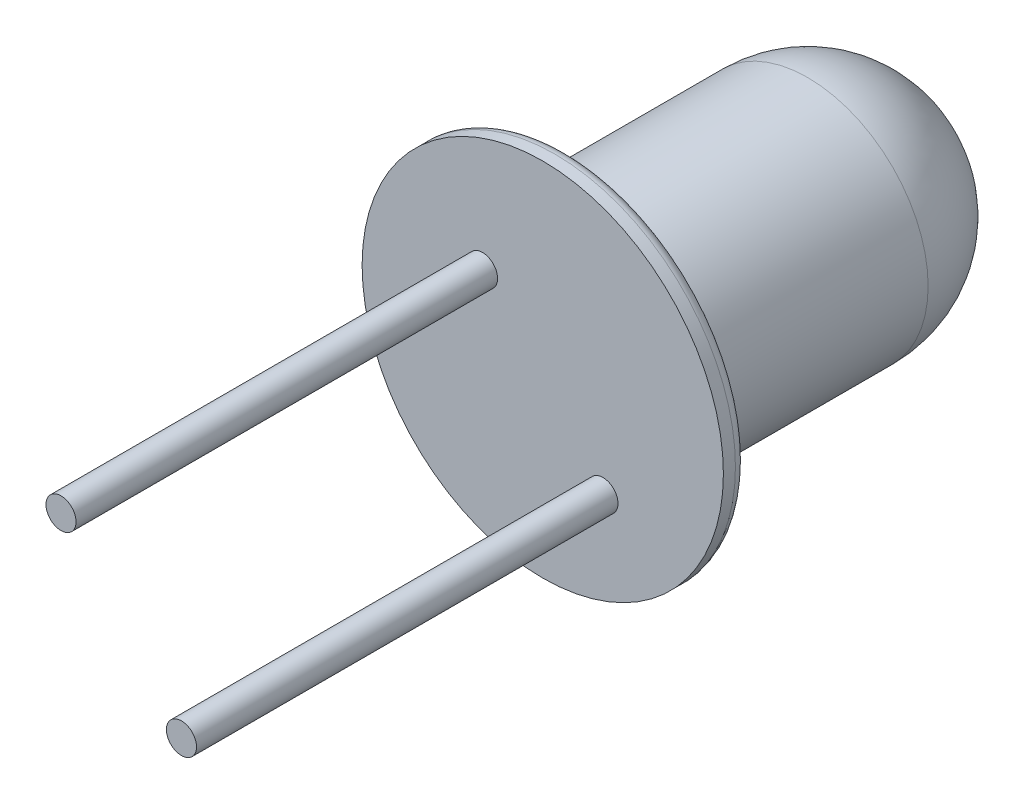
ISO-10303-21;
HEADER;
FILE_DESCRIPTION(('STEP AP214'),'2;1');
FILE_NAME('part.step','',(''),(''),'','','');
FILE_SCHEMA(('AUTOMOTIVE_DESIGN { 1 0 10303 214 1 1 1 1 }'));
ENDSEC;
DATA;
#1=APPLICATION_CONTEXT('core data for automotive mechanical design processes');
#2=APPLICATION_PROTOCOL_DEFINITION('international standard','automotive_design',2000,#1);
#3=PRODUCT_CONTEXT('',#1,'mechanical');
#4=PRODUCT('Part','Part','',(#3));
#5=PRODUCT_RELATED_PRODUCT_CATEGORY('part','',(#4));
#6=PRODUCT_DEFINITION_FORMATION('','',#4);
#7=PRODUCT_DEFINITION_CONTEXT('part definition',#1,'design');
#8=PRODUCT_DEFINITION('design','',#6,#7);
#9=PRODUCT_DEFINITION_SHAPE('','',#8);
#10=(LENGTH_UNIT() NAMED_UNIT(*) SI_UNIT(.MILLI.,.METRE.));
#11=(NAMED_UNIT(*) PLANE_ANGLE_UNIT() SI_UNIT($,.RADIAN.));
#12=(NAMED_UNIT(*) SI_UNIT($,.STERADIAN.) SOLID_ANGLE_UNIT());
#13=UNCERTAINTY_MEASURE_WITH_UNIT(LENGTH_MEASURE(1.E-05),#10,'distance_accuracy_value','');
#14=(GEOMETRIC_REPRESENTATION_CONTEXT(3) GLOBAL_UNCERTAINTY_ASSIGNED_CONTEXT((#13)) GLOBAL_UNIT_ASSIGNED_CONTEXT((#10,
#11,#12)) REPRESENTATION_CONTEXT('',''));
#15=CARTESIAN_POINT('',(0.,0.,0.));
#16=DIRECTION('',(0.,0.,1.));
#17=DIRECTION('',(1.,0.,0.));
#18=AXIS2_PLACEMENT_3D('',#15,#16,#17);
#19=CARTESIAN_POINT('',(12.2184902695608,5.6724130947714,0.2));
#20=DIRECTION('',(0.,0.,1.));
#21=DIRECTION('',(1.,0.,0.));
#22=AXIS2_PLACEMENT_3D('',#19,#20,#21);
#23=PLANE('',#22);
#24=CARTESIAN_POINT('',(11.7184902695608,6.13915929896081,0.2));
#25=DIRECTION('',(0.,0.,1.));
#26=DIRECTION('',(1.,0.,0.));
#27=AXIS2_PLACEMENT_3D('',#24,#25,#26);
#28=CIRCLE('',#27,0.125);
#29=CARTESIAN_POINT('',(11.8434902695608,6.13915929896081,0.2));
#30=VERTEX_POINT('',#29);
#31=EDGE_CURVE('E55',#30,#30,#28,.T.);
#32=ORIENTED_EDGE('',*,*,#31,.F.);
#33=EDGE_LOOP('',(#32));
#34=FACE_BOUND('',#33,.T.);
#35=CARTESIAN_POINT('',(12.2184902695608,5.6724130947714,0.2));
#36=DIRECTION('',(0.,0.,1.));
#37=DIRECTION('',(1.,0.,0.));
#38=AXIS2_PLACEMENT_3D('',#35,#36,#37);
#39=CIRCLE('',#38,1.5);
#40=CARTESIAN_POINT('',(13.7184902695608,5.6724130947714,0.2));
#41=VERTEX_POINT('',#40);
#42=EDGE_CURVE('E51',#41,#41,#39,.T.);
#43=ORIENTED_EDGE('',*,*,#42,.T.);
#44=EDGE_LOOP('',(#43));
#45=FACE_BOUND('',#44,.T.);
#46=CARTESIAN_POINT('',(12.7184902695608,5.02112531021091,0.2));
#47=DIRECTION('',(0.,0.,1.));
#48=DIRECTION('',(1.,0.,0.));
#49=AXIS2_PLACEMENT_3D('',#46,#47,#48);
#50=CIRCLE('',#49,0.125);
#51=CARTESIAN_POINT('',(12.8434902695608,5.02112531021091,0.2));
#52=VERTEX_POINT('',#51);
#53=EDGE_CURVE('E61',#52,#52,#50,.T.);
#54=ORIENTED_EDGE('',*,*,#53,.F.);
#55=EDGE_LOOP('',(#54));
#56=FACE_BOUND('',#55,.T.);
#57=ADVANCED_FACE('F28',(#34,#45,#56),#23,.T.);
#58=CARTESIAN_POINT('',(12.2184902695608,5.6724130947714,-5.82842712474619));
#59=DIRECTION('',(0.,0.,1.));
#60=DIRECTION('',(1.,0.,0.));
#61=AXIS2_PLACEMENT_3D('',#58,#59,#60);
#62=CYLINDRICAL_SURFACE('',#61,1.);
#63=CARTESIAN_POINT('',(12.2184902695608,5.6724130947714,-0.1));
#64=DIRECTION('',(0.,0.,1.));
#65=DIRECTION('',(1.,0.,0.));
#66=AXIS2_PLACEMENT_3D('',#63,#64,#65);
#67=CIRCLE('',#66,1.);
#68=CARTESIAN_POINT('',(13.2184902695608,5.6724130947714,-0.100000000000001));
#69=VERTEX_POINT('',#68);
#70=EDGE_CURVE('E10',#69,#69,#67,.F.);
#71=CARTESIAN_POINT('',(12.2184902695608,5.6724130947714,-2.));
#72=DIRECTION('',(0.,0.,1.));
#73=DIRECTION('',(1.,0.,0.));
#74=AXIS2_PLACEMENT_3D('',#71,#72,#73);
#75=CIRCLE('',#74,1.);
#76=CARTESIAN_POINT('',(13.2184902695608,5.6724130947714,-2.));
#77=VERTEX_POINT('',#76);
#78=EDGE_CURVE('E48',#77,#77,#75,.T.);
#79=CARTESIAN_POINT('',(13.2184902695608,5.6724130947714,-0.100000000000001));
#80=CARTESIAN_POINT('',(13.2184902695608,5.6724130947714,-0.119791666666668));
#81=CARTESIAN_POINT('',(13.2184902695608,5.6724130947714,-0.139583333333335));
#82=CARTESIAN_POINT('',(13.2184902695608,5.6724130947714,-0.179166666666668));
#83=CARTESIAN_POINT('',(13.2184902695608,5.6724130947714,-0.198958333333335));
#84=CARTESIAN_POINT('',(13.2184902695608,5.6724130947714,-0.238541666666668));
#85=CARTESIAN_POINT('',(13.2184902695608,5.6724130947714,-0.258333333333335));
#86=CARTESIAN_POINT('',(13.2184902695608,5.6724130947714,-0.297916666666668));
#87=CARTESIAN_POINT('',(13.2184902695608,5.6724130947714,-0.317708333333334));
#88=CARTESIAN_POINT('',(13.2184902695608,5.6724130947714,-0.357291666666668));
#89=CARTESIAN_POINT('',(13.2184902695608,5.6724130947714,-0.377083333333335));
#90=CARTESIAN_POINT('',(13.2184902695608,5.6724130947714,-0.416666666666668));
#91=CARTESIAN_POINT('',(13.2184902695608,5.6724130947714,-0.436458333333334));
#92=CARTESIAN_POINT('',(13.2184902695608,5.6724130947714,-0.476041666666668));
#93=CARTESIAN_POINT('',(13.2184902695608,5.6724130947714,-0.495833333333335));
#94=CARTESIAN_POINT('',(13.2184902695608,5.6724130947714,-0.535416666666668));
#95=CARTESIAN_POINT('',(13.2184902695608,5.6724130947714,-0.555208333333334));
#96=CARTESIAN_POINT('',(13.2184902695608,5.6724130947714,-0.594791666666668));
#97=CARTESIAN_POINT('',(13.2184902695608,5.6724130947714,-0.614583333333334));
#98=CARTESIAN_POINT('',(13.2184902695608,5.6724130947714,-0.654166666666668));
#99=CARTESIAN_POINT('',(13.2184902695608,5.6724130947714,-0.673958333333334));
#100=CARTESIAN_POINT('',(13.2184902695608,5.6724130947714,-0.713541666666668));
#101=CARTESIAN_POINT('',(13.2184902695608,5.6724130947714,-0.733333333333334));
#102=CARTESIAN_POINT('',(13.2184902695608,5.6724130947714,-0.772916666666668));
#103=CARTESIAN_POINT('',(13.2184902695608,5.6724130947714,-0.792708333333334));
#104=CARTESIAN_POINT('',(13.2184902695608,5.6724130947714,-0.832291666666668));
#105=CARTESIAN_POINT('',(13.2184902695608,5.6724130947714,-0.852083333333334));
#106=CARTESIAN_POINT('',(13.2184902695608,5.6724130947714,-0.891666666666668));
#107=CARTESIAN_POINT('',(13.2184902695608,5.6724130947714,-0.911458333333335));
#108=CARTESIAN_POINT('',(13.2184902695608,5.6724130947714,-0.951041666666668));
#109=CARTESIAN_POINT('',(13.2184902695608,5.6724130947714,-0.970833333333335));
#110=CARTESIAN_POINT('',(13.2184902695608,5.6724130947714,-1.01041666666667));
#111=CARTESIAN_POINT('',(13.2184902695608,5.6724130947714,-1.03020833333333));
#112=CARTESIAN_POINT('',(13.2184902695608,5.6724130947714,-1.06979166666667));
#113=CARTESIAN_POINT('',(13.2184902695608,5.6724130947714,-1.08958333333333));
#114=CARTESIAN_POINT('',(13.2184902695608,5.6724130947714,-1.12916666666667));
#115=CARTESIAN_POINT('',(13.2184902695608,5.6724130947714,-1.14895833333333));
#116=CARTESIAN_POINT('',(13.2184902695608,5.6724130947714,-1.18854166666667));
#117=CARTESIAN_POINT('',(13.2184902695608,5.6724130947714,-1.20833333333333));
#118=CARTESIAN_POINT('',(13.2184902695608,5.6724130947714,-1.24791666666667));
#119=CARTESIAN_POINT('',(13.2184902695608,5.6724130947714,-1.26770833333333));
#120=CARTESIAN_POINT('',(13.2184902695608,5.6724130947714,-1.30729166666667));
#121=CARTESIAN_POINT('',(13.2184902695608,5.6724130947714,-1.32708333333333));
#122=CARTESIAN_POINT('',(13.2184902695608,5.6724130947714,-1.36666666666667));
#123=CARTESIAN_POINT('',(13.2184902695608,5.6724130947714,-1.38645833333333));
#124=CARTESIAN_POINT('',(13.2184902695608,5.6724130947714,-1.42604166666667));
#125=CARTESIAN_POINT('',(13.2184902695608,5.6724130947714,-1.44583333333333));
#126=CARTESIAN_POINT('',(13.2184902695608,5.6724130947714,-1.48541666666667));
#127=CARTESIAN_POINT('',(13.2184902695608,5.6724130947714,-1.50520833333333));
#128=CARTESIAN_POINT('',(13.2184902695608,5.6724130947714,-1.54479166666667));
#129=CARTESIAN_POINT('',(13.2184902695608,5.6724130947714,-1.56458333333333));
#130=CARTESIAN_POINT('',(13.2184902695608,5.6724130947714,-1.60416666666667));
#131=CARTESIAN_POINT('',(13.2184902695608,5.6724130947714,-1.62395833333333));
#132=CARTESIAN_POINT('',(13.2184902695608,5.6724130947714,-1.66354166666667));
#133=CARTESIAN_POINT('',(13.2184902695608,5.6724130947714,-1.68333333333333));
#134=CARTESIAN_POINT('',(13.2184902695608,5.6724130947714,-1.72291666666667));
#135=CARTESIAN_POINT('',(13.2184902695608,5.6724130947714,-1.74270833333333));
#136=CARTESIAN_POINT('',(13.2184902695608,5.6724130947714,-1.78229166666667));
#137=CARTESIAN_POINT('',(13.2184902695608,5.6724130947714,-1.80208333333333));
#138=CARTESIAN_POINT('',(13.2184902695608,5.6724130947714,-1.84166666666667));
#139=CARTESIAN_POINT('',(13.2184902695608,5.6724130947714,-1.86145833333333));
#140=CARTESIAN_POINT('',(13.2184902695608,5.6724130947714,-1.90104166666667));
#141=CARTESIAN_POINT('',(13.2184902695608,5.6724130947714,-1.92083333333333));
#142=CARTESIAN_POINT('',(13.2184902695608,5.6724130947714,-1.96041666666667));
#143=CARTESIAN_POINT('',(13.2184902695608,5.6724130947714,-1.98020833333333));
#144=CARTESIAN_POINT('',(13.2184902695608,5.6724130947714,-2.));
#145=B_SPLINE_CURVE_WITH_KNOTS('',3,(#79,#80,#81,#82,#83,#84,#85,#86,#87,#88,#89,#90,#91,#92,
#93,#94,#95,#96,#97,#98,#99,#100,#101,#102,#103,#104,#105,#106,#107,#108,#109,#110,#111,#112,
#113,#114,#115,#116,#117,#118,#119,#120,#121,#122,#123,#124,#125,#126,#127,#128,#129,#130,#131,
#132,#133,#134,#135,#136,#137,#138,#139,#140,#141,#142,#143,#144),.UNSPECIFIED.,.F.,.F.,(4,2,2,
2,2,2,2,2,2,2,2,2,2,2,2,2,2,2,2,2,2,2,2,2,2,2,2,2,2,2,2,2,4),(0.,0.0593750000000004,0.11875,
0.178125,0.2375,0.296875,0.35625,0.415625,0.475,0.534375,0.59375,0.653125,0.7125,0.771875,
0.83125,0.890625,0.95,1.009375,1.06875,1.128125,1.1875,1.246875,1.30625,1.365625,1.425,1.484375,
1.54375,1.603125,1.6625,1.721875,1.78125,1.840625,1.9),.UNSPECIFIED.);
#146=EDGE_CURVE('BSEAM77',#69,#77,#145,.T.);
#147=ORIENTED_EDGE('',*,*,#70,.T.);
#148=ORIENTED_EDGE('',*,*,#78,.T.);
#149=ORIENTED_EDGE('',*,*,#146,.T.);
#150=ORIENTED_EDGE('',*,*,#146,.F.);
#151=EDGE_LOOP('',(#147,#149,#148,#150));
#152=FACE_BOUND('',#151,.T.);
#153=ADVANCED_FACE('F77',(#152),#62,.T.);
#154=CARTESIAN_POINT('',(12.2184902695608,5.6724130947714,-2.));
#155=DIRECTION('',(0.,0.,1.));
#156=DIRECTION('',(1.,0.,0.));
#157=AXIS2_PLACEMENT_3D('',#154,#155,#156);
#158=SPHERICAL_SURFACE('',#157,1.);
#159=ORIENTED_EDGE('',*,*,#78,.F.);
#160=EDGE_LOOP('',(#159));
#161=FACE_BOUND('',#160,.T.);
#162=ADVANCED_FACE('F83',(#161),#158,.T.);
#163=CARTESIAN_POINT('',(12.2184902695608,5.6724130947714,0.2));
#164=DIRECTION('',(0.,0.,-1.));
#165=DIRECTION('',(-1.,0.,0.));
#166=AXIS2_PLACEMENT_3D('',#163,#164,#165);
#167=CYLINDRICAL_SURFACE('',#166,1.5);
#168=CARTESIAN_POINT('',(12.2184902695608,5.6724130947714,0.1));
#169=DIRECTION('',(0.,0.,1.));
#170=DIRECTION('',(1.,0.,0.));
#171=AXIS2_PLACEMENT_3D('',#168,#169,#170);
#172=CIRCLE('',#171,1.5);
#173=CARTESIAN_POINT('',(13.7184902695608,5.6724130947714,0.1));
#174=VERTEX_POINT('',#173);
#175=EDGE_CURVE('E43',#174,#174,#172,.T.);
#176=ORIENTED_EDGE('',*,*,#175,.T.);
#177=EDGE_LOOP('',(#176));
#178=FACE_BOUND('',#177,.T.);
#179=ORIENTED_EDGE('',*,*,#42,.F.);
#180=EDGE_LOOP('',(#179));
#181=FACE_BOUND('',#180,.T.);
#182=ADVANCED_FACE('F95',(#178,#181),#167,.T.);
#183=CARTESIAN_POINT('',(12.2184902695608,5.6724130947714,0.));
#184=DIRECTION('',(0.,0.,1.));
#185=DIRECTION('',(1.,0.,0.));
#186=AXIS2_PLACEMENT_3D('',#183,#184,#185);
#187=PLANE('',#186);
#188=CARTESIAN_POINT('',(12.2184902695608,5.6724130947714,0.));
#189=DIRECTION('',(0.,0.,1.));
#190=DIRECTION('',(1.,0.,0.));
#191=AXIS2_PLACEMENT_3D('',#188,#189,#190);
#192=CIRCLE('',#191,1.1);
#193=CARTESIAN_POINT('',(13.3184902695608,5.6724130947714,0.));
#194=VERTEX_POINT('',#193);
#195=EDGE_CURVE('E35',#194,#194,#192,.T.);
#196=ORIENTED_EDGE('',*,*,#195,.T.);
#197=EDGE_LOOP('',(#196));
#198=FACE_BOUND('',#197,.T.);
#199=CARTESIAN_POINT('',(12.2184902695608,5.6724130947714,0.));
#200=DIRECTION('',(0.,0.,1.));
#201=DIRECTION('',(1.,0.,0.));
#202=AXIS2_PLACEMENT_3D('',#199,#200,#201);
#203=CIRCLE('',#202,1.4);
#204=CARTESIAN_POINT('',(13.6184902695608,5.6724130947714,0.));
#205=VERTEX_POINT('',#204);
#206=EDGE_CURVE('E39',#205,#205,#203,.F.);
#207=ORIENTED_EDGE('',*,*,#206,.T.);
#208=EDGE_LOOP('',(#207));
#209=FACE_BOUND('',#208,.T.);
#210=ADVANCED_FACE('F91',(#198,#209),#187,.F.);
#211=CARTESIAN_POINT('',(12.2184902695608,5.6724130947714,0.1));
#212=DIRECTION('',(0.,0.,1.));
#213=DIRECTION('',(1.,0.,0.));
#214=AXIS2_PLACEMENT_3D('',#211,#212,#213);
#215=TOROIDAL_SURFACE('',#214,1.4,0.1);
#216=ORIENTED_EDGE('',*,*,#206,.F.);
#217=EDGE_LOOP('',(#216));
#218=FACE_BOUND('',#217,.T.);
#219=ORIENTED_EDGE('',*,*,#175,.F.);
#220=EDGE_LOOP('',(#219));
#221=FACE_BOUND('',#220,.T.);
#222=ADVANCED_FACE('F94',(#218,#221),#215,.T.);
#223=CARTESIAN_POINT('',(12.2184902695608,5.6724130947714,-0.1));
#224=DIRECTION('',(0.,0.,1.));
#225=DIRECTION('',(1.,0.,0.));
#226=AXIS2_PLACEMENT_3D('',#223,#224,#225);
#227=TOROIDAL_SURFACE('',#226,1.1,0.1);
#228=ORIENTED_EDGE('',*,*,#70,.F.);
#229=EDGE_LOOP('',(#228));
#230=FACE_BOUND('',#229,.T.);
#231=ORIENTED_EDGE('',*,*,#195,.F.);
#232=EDGE_LOOP('',(#231));
#233=FACE_BOUND('',#232,.T.);
#234=ADVANCED_FACE('F30',(#230,#233),#227,.F.);
#235=CARTESIAN_POINT('',(11.7184902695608,6.13915929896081,3.7));
#236=DIRECTION('',(0.,0.,-1.));
#237=DIRECTION('',(-1.,0.,0.));
#238=AXIS2_PLACEMENT_3D('',#235,#236,#237);
#239=CYLINDRICAL_SURFACE('',#238,0.125);
#240=CARTESIAN_POINT('',(11.7184902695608,6.13915929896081,3.7));
#241=DIRECTION('',(0.,0.,1.));
#242=DIRECTION('',(1.,0.,0.));
#243=AXIS2_PLACEMENT_3D('',#240,#241,#242);
#244=CIRCLE('',#243,0.125);
#245=CARTESIAN_POINT('',(11.8434902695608,6.13915929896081,3.7));
#246=VERTEX_POINT('',#245);
#247=EDGE_CURVE('E54',#246,#246,#244,.T.);
#248=ORIENTED_EDGE('',*,*,#247,.F.);
#249=EDGE_LOOP('',(#248));
#250=FACE_BOUND('',#249,.T.);
#251=ORIENTED_EDGE('',*,*,#31,.T.);
#252=EDGE_LOOP('',(#251));
#253=FACE_BOUND('',#252,.T.);
#254=ADVANCED_FACE('F89',(#250,#253),#239,.T.);
#255=CARTESIAN_POINT('',(11.7184902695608,6.13915929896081,3.7));
#256=DIRECTION('',(0.,0.,1.));
#257=DIRECTION('',(1.,0.,0.));
#258=AXIS2_PLACEMENT_3D('',#255,#256,#257);
#259=PLANE('',#258);
#260=ORIENTED_EDGE('',*,*,#247,.T.);
#261=EDGE_LOOP('',(#260));
#262=FACE_BOUND('',#261,.T.);
#263=ADVANCED_FACE('F72',(#262),#259,.T.);
#264=CARTESIAN_POINT('',(12.7184902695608,5.02112531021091,3.7));
#265=DIRECTION('',(0.,0.,-1.));
#266=DIRECTION('',(-1.,0.,0.));
#267=AXIS2_PLACEMENT_3D('',#264,#265,#266);
#268=CYLINDRICAL_SURFACE('',#267,0.125);
#269=CARTESIAN_POINT('',(12.7184902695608,5.02112531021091,3.7));
#270=DIRECTION('',(0.,0.,1.));
#271=DIRECTION('',(1.,0.,0.));
#272=AXIS2_PLACEMENT_3D('',#269,#270,#271);
#273=CIRCLE('',#272,0.125);
#274=CARTESIAN_POINT('',(12.8434902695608,5.02112531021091,3.7));
#275=VERTEX_POINT('',#274);
#276=EDGE_CURVE('E58',#275,#275,#273,.T.);
#277=ORIENTED_EDGE('',*,*,#276,.F.);
#278=EDGE_LOOP('',(#277));
#279=FACE_BOUND('',#278,.T.);
#280=ORIENTED_EDGE('',*,*,#53,.T.);
#281=EDGE_LOOP('',(#280));
#282=FACE_BOUND('',#281,.T.);
#283=ADVANCED_FACE('F69',(#279,#282),#268,.T.);
#284=CARTESIAN_POINT('',(12.7184902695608,5.02112531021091,3.7));
#285=DIRECTION('',(0.,0.,1.));
#286=DIRECTION('',(1.,0.,0.));
#287=AXIS2_PLACEMENT_3D('',#284,#285,#286);
#288=PLANE('',#287);
#289=ORIENTED_EDGE('',*,*,#276,.T.);
#290=EDGE_LOOP('',(#289));
#291=FACE_BOUND('',#290,.T.);
#292=ADVANCED_FACE('F67',(#291),#288,.T.);
#293=CLOSED_SHELL('',(#57,#153,#162,#182,#210,#222,#234,#254,#263,#283,#292));
#294=MANIFOLD_SOLID_BREP('B2',#293);
#295=ADVANCED_BREP_SHAPE_REPRESENTATION('',(#18,#294),#14);
#296=SHAPE_DEFINITION_REPRESENTATION(#9,#295);
ENDSEC;
END-ISO-10303-21;
